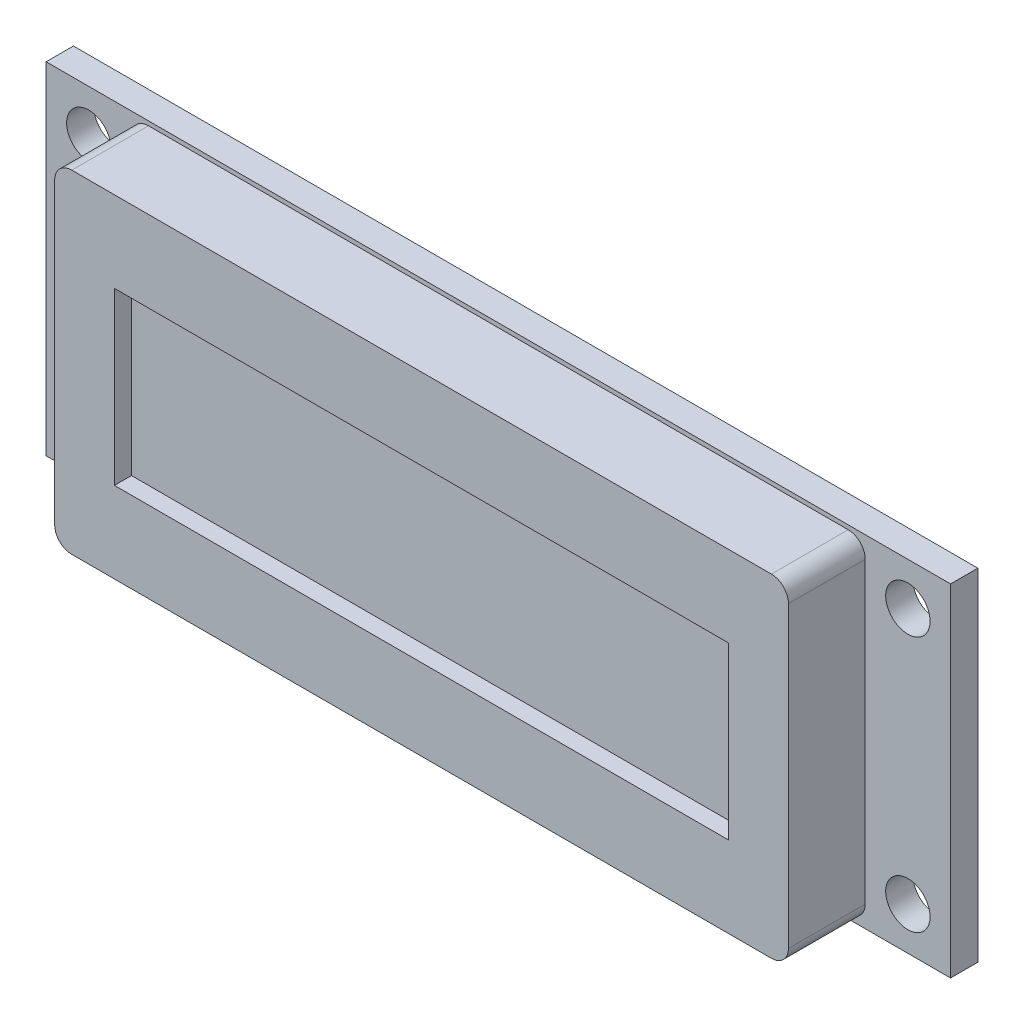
ISO-10303-21;
HEADER;
FILE_DESCRIPTION(('STEP AP214'),'2;1');
FILE_NAME('part.step','',(''),(''),'','','');
FILE_SCHEMA(('AUTOMOTIVE_DESIGN { 1 0 10303 214 1 1 1 1 }'));
ENDSEC;
DATA;
#1=APPLICATION_CONTEXT('core data for automotive mechanical design processes');
#2=APPLICATION_PROTOCOL_DEFINITION('international standard','automotive_design',2000,#1);
#3=PRODUCT_CONTEXT('',#1,'mechanical');
#4=PRODUCT('Part','Part','',(#3));
#5=PRODUCT_RELATED_PRODUCT_CATEGORY('part','',(#4));
#6=PRODUCT_DEFINITION_FORMATION('','',#4);
#7=PRODUCT_DEFINITION_CONTEXT('part definition',#1,'design');
#8=PRODUCT_DEFINITION('design','',#6,#7);
#9=PRODUCT_DEFINITION_SHAPE('','',#8);
#10=(LENGTH_UNIT() NAMED_UNIT(*) SI_UNIT(.MILLI.,.METRE.));
#11=(NAMED_UNIT(*) PLANE_ANGLE_UNIT() SI_UNIT($,.RADIAN.));
#12=(NAMED_UNIT(*) SI_UNIT($,.STERADIAN.) SOLID_ANGLE_UNIT());
#13=UNCERTAINTY_MEASURE_WITH_UNIT(LENGTH_MEASURE(1.E-05),#10,'distance_accuracy_value','');
#14=(GEOMETRIC_REPRESENTATION_CONTEXT(3) GLOBAL_UNCERTAINTY_ASSIGNED_CONTEXT((#13)) GLOBAL_UNIT_ASSIGNED_CONTEXT((#10,
#11,#12)) REPRESENTATION_CONTEXT('',''));
#15=CARTESIAN_POINT('',(0.,0.,0.));
#16=DIRECTION('',(0.,0.,1.));
#17=DIRECTION('',(1.,0.,0.));
#18=AXIS2_PLACEMENT_3D('',#15,#16,#17);
#19=CARTESIAN_POINT('',(0.,5.,4.5));
#20=DIRECTION('',(0.,1.,0.));
#21=DIRECTION('',(0.,0.,1.));
#22=AXIS2_PLACEMENT_3D('',#19,#20,#21);
#23=PLANE('',#22);
#24=DIRECTION('',(-1.,0.,0.));
#25=VECTOR('',#24,1.);
#26=CARTESIAN_POINT('',(18.,5.,3.5));
#27=LINE('',#26,#25);
#28=CARTESIAN_POINT('',(18.,5.,3.5));
#29=VERTEX_POINT('',#28);
#30=CARTESIAN_POINT('',(-18.,5.,3.5));
#31=VERTEX_POINT('',#30);
#32=EDGE_CURVE('E254',#29,#31,#27,.T.);
#33=ORIENTED_EDGE('',*,*,#32,.F.);
#34=DIRECTION('',(0.,0.,-1.));
#35=VECTOR('',#34,1.);
#36=CARTESIAN_POINT('',(18.,5.,4.5));
#37=LINE('',#36,#35);
#38=CARTESIAN_POINT('',(18.,5.,4.5));
#39=VERTEX_POINT('',#38);
#40=EDGE_CURVE('E329',#39,#29,#37,.T.);
#41=ORIENTED_EDGE('',*,*,#40,.F.);
#42=DIRECTION('',(1.,0.,0.));
#43=VECTOR('',#42,1.);
#44=CARTESIAN_POINT('',(0.,5.,4.5));
#45=LINE('',#44,#43);
#46=CARTESIAN_POINT('',(-18.,5.,4.5));
#47=VERTEX_POINT('',#46);
#48=EDGE_CURVE('E266',#47,#39,#45,.T.);
#49=ORIENTED_EDGE('',*,*,#48,.F.);
#50=DIRECTION('',(0.,0.,-1.));
#51=VECTOR('',#50,1.);
#52=CARTESIAN_POINT('',(-18.,5.,4.5));
#53=LINE('',#52,#51);
#54=EDGE_CURVE('E243',#47,#31,#53,.T.);
#55=ORIENTED_EDGE('',*,*,#54,.T.);
#56=EDGE_LOOP('',(#33,#41,#49,#55));
#57=FACE_BOUND('',#56,.T.);
#58=ADVANCED_FACE('F95',(#57),#23,.F.);
#59=CARTESIAN_POINT('',(18.,0.,4.5));
#60=DIRECTION('',(1.,0.,0.));
#61=DIRECTION('',(0.,0.,-1.));
#62=AXIS2_PLACEMENT_3D('',#59,#60,#61);
#63=PLANE('',#62);
#64=DIRECTION('',(0.,1.,0.));
#65=VECTOR('',#64,1.);
#66=CARTESIAN_POINT('',(18.,5.,3.5));
#67=LINE('',#66,#65);
#68=CARTESIAN_POINT('',(18.,-5.,3.5));
#69=VERTEX_POINT('',#68);
#70=EDGE_CURVE('E257',#69,#29,#67,.T.);
#71=ORIENTED_EDGE('',*,*,#70,.F.);
#72=DIRECTION('',(0.,0.,-1.));
#73=VECTOR('',#72,1.);
#74=CARTESIAN_POINT('',(18.,-5.,4.5));
#75=LINE('',#74,#73);
#76=CARTESIAN_POINT('',(18.,-5.,4.5));
#77=VERTEX_POINT('',#76);
#78=EDGE_CURVE('E357',#77,#69,#75,.T.);
#79=ORIENTED_EDGE('',*,*,#78,.F.);
#80=DIRECTION('',(0.,-1.,0.));
#81=VECTOR('',#80,1.);
#82=CARTESIAN_POINT('',(18.,0.,4.5));
#83=LINE('',#82,#81);
#84=EDGE_CURVE('E269',#39,#77,#83,.T.);
#85=ORIENTED_EDGE('',*,*,#84,.F.);
#86=ORIENTED_EDGE('',*,*,#40,.T.);
#87=EDGE_LOOP('',(#71,#79,#85,#86));
#88=FACE_BOUND('',#87,.T.);
#89=ADVANCED_FACE('F440',(#88),#63,.F.);
#90=CARTESIAN_POINT('',(0.,-5.,4.5));
#91=DIRECTION('',(0.,1.,0.));
#92=DIRECTION('',(0.,0.,1.));
#93=AXIS2_PLACEMENT_3D('',#90,#91,#92);
#94=PLANE('',#93);
#95=ORIENTED_EDGE('',*,*,#78,.T.);
#96=DIRECTION('',(1.,0.,0.));
#97=VECTOR('',#96,1.);
#98=CARTESIAN_POINT('',(18.,-5.,3.5));
#99=LINE('',#98,#97);
#100=CARTESIAN_POINT('',(-18.,-5.,3.5));
#101=VERTEX_POINT('',#100);
#102=EDGE_CURVE('E263',#101,#69,#99,.T.);
#103=ORIENTED_EDGE('',*,*,#102,.F.);
#104=DIRECTION('',(0.,0.,-1.));
#105=VECTOR('',#104,1.);
#106=CARTESIAN_POINT('',(-18.,-5.,4.5));
#107=LINE('',#106,#105);
#108=CARTESIAN_POINT('',(-18.,-5.,4.5));
#109=VERTEX_POINT('',#108);
#110=EDGE_CURVE('E353',#109,#101,#107,.T.);
#111=ORIENTED_EDGE('',*,*,#110,.F.);
#112=DIRECTION('',(1.,0.,0.));
#113=VECTOR('',#112,1.);
#114=CARTESIAN_POINT('',(0.,-5.,4.5));
#115=LINE('',#114,#113);
#116=EDGE_CURVE('E272',#109,#77,#115,.T.);
#117=ORIENTED_EDGE('',*,*,#116,.T.);
#118=EDGE_LOOP('',(#95,#103,#111,#117));
#119=FACE_BOUND('',#118,.T.);
#120=ADVANCED_FACE('F436',(#119),#94,.T.);
#121=CARTESIAN_POINT('',(-18.,0.,4.5));
#122=DIRECTION('',(1.,0.,0.));
#123=DIRECTION('',(0.,0.,-1.));
#124=AXIS2_PLACEMENT_3D('',#121,#122,#123);
#125=PLANE('',#124);
#126=ORIENTED_EDGE('',*,*,#110,.T.);
#127=DIRECTION('',(0.,-1.,0.));
#128=VECTOR('',#127,1.);
#129=CARTESIAN_POINT('',(-18.,5.,3.5));
#130=LINE('',#129,#128);
#131=EDGE_CURVE('E261',#31,#101,#130,.T.);
#132=ORIENTED_EDGE('',*,*,#131,.F.);
#133=ORIENTED_EDGE('',*,*,#54,.F.);
#134=DIRECTION('',(0.,-1.,0.));
#135=VECTOR('',#134,1.);
#136=CARTESIAN_POINT('',(-18.,0.,4.5));
#137=LINE('',#136,#135);
#138=EDGE_CURVE('E275',#47,#109,#137,.T.);
#139=ORIENTED_EDGE('',*,*,#138,.T.);
#140=EDGE_LOOP('',(#126,#132,#133,#139));
#141=FACE_BOUND('',#140,.T.);
#142=ADVANCED_FACE('F431',(#141),#125,.T.);
#143=CARTESIAN_POINT('',(26.5,10.,-1.6));
#144=DIRECTION('',(-1.,0.,0.));
#145=DIRECTION('',(0.,-1.,0.));
#146=AXIS2_PLACEMENT_3D('',#143,#144,#145);
#147=PLANE('',#146);
#148=DIRECTION('',(0.,-1.,0.));
#149=VECTOR('',#148,1.);
#150=CARTESIAN_POINT('',(26.5,10.,0.));
#151=LINE('',#150,#149);
#152=CARTESIAN_POINT('',(26.5,10.,0.));
#153=VERTEX_POINT('',#152);
#154=CARTESIAN_POINT('',(26.5,-9.99999999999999,0.));
#155=VERTEX_POINT('',#154);
#156=EDGE_CURVE('E383',#153,#155,#151,.T.);
#157=ORIENTED_EDGE('',*,*,#156,.T.);
#158=DIRECTION('',(0.,0.,1.));
#159=VECTOR('',#158,1.);
#160=CARTESIAN_POINT('',(26.5,-9.99999999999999,-1.6));
#161=LINE('',#160,#159);
#162=CARTESIAN_POINT('',(26.5,-9.99999999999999,-1.6));
#163=VERTEX_POINT('',#162);
#164=EDGE_CURVE('E12',#163,#155,#161,.T.);
#165=ORIENTED_EDGE('',*,*,#164,.F.);
#166=DIRECTION('',(0.,-1.,0.));
#167=VECTOR('',#166,1.);
#168=CARTESIAN_POINT('',(26.5,10.,-1.6));
#169=LINE('',#168,#167);
#170=CARTESIAN_POINT('',(26.5,10.,-1.6));
#171=VERTEX_POINT('',#170);
#172=EDGE_CURVE('E386',#171,#163,#169,.T.);
#173=ORIENTED_EDGE('',*,*,#172,.F.);
#174=DIRECTION('',(0.,0.,1.));
#175=VECTOR('',#174,1.);
#176=CARTESIAN_POINT('',(26.5,10.,-1.6));
#177=LINE('',#176,#175);
#178=EDGE_CURVE('E398',#171,#153,#177,.T.);
#179=ORIENTED_EDGE('',*,*,#178,.T.);
#180=EDGE_LOOP('',(#157,#165,#173,#179));
#181=FACE_BOUND('',#180,.T.);
#182=ADVANCED_FACE('F97',(#181),#147,.F.);
#183=CARTESIAN_POINT('',(26.5,-9.99999999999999,-1.6));
#184=DIRECTION('',(0.,1.,0.));
#185=DIRECTION('',(-1.,0.,0.));
#186=AXIS2_PLACEMENT_3D('',#183,#184,#185);
#187=PLANE('',#186);
#188=DIRECTION('',(-1.,0.,0.));
#189=VECTOR('',#188,1.);
#190=CARTESIAN_POINT('',(26.5,-9.99999999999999,0.));
#191=LINE('',#190,#189);
#192=CARTESIAN_POINT('',(-26.5,-10.,0.));
#193=VERTEX_POINT('',#192);
#194=EDGE_CURVE('E401',#155,#193,#191,.T.);
#195=ORIENTED_EDGE('',*,*,#194,.T.);
#196=DIRECTION('',(0.,0.,1.));
#197=VECTOR('',#196,1.);
#198=CARTESIAN_POINT('',(-26.5,-10.,-1.6));
#199=LINE('',#198,#197);
#200=CARTESIAN_POINT('',(-26.5,-10.,-1.6));
#201=VERTEX_POINT('',#200);
#202=EDGE_CURVE('E104',#201,#193,#199,.T.);
#203=ORIENTED_EDGE('',*,*,#202,.F.);
#204=DIRECTION('',(-1.,0.,0.));
#205=VECTOR('',#204,1.);
#206=CARTESIAN_POINT('',(26.5,-9.99999999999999,-1.6));
#207=LINE('',#206,#205);
#208=EDGE_CURVE('E389',#163,#201,#207,.T.);
#209=ORIENTED_EDGE('',*,*,#208,.F.);
#210=ORIENTED_EDGE('',*,*,#164,.T.);
#211=EDGE_LOOP('',(#195,#203,#209,#210));
#212=FACE_BOUND('',#211,.T.);
#213=ADVANCED_FACE('F417',(#212),#187,.F.);
#214=CARTESIAN_POINT('',(-26.5,10.,-1.6));
#215=DIRECTION('',(-1.,0.,0.));
#216=DIRECTION('',(0.,-1.,0.));
#217=AXIS2_PLACEMENT_3D('',#214,#215,#216);
#218=PLANE('',#217);
#219=DIRECTION('',(0.,-1.,0.));
#220=VECTOR('',#219,1.);
#221=CARTESIAN_POINT('',(-26.5,10.,0.));
#222=LINE('',#221,#220);
#223=CARTESIAN_POINT('',(-26.5,10.,0.));
#224=VERTEX_POINT('',#223);
#225=EDGE_CURVE('E404',#224,#193,#222,.T.);
#226=ORIENTED_EDGE('',*,*,#225,.F.);
#227=DIRECTION('',(0.,0.,1.));
#228=VECTOR('',#227,1.);
#229=CARTESIAN_POINT('',(-26.5,10.,-1.6));
#230=LINE('',#229,#228);
#231=CARTESIAN_POINT('',(-26.5,10.,-1.6));
#232=VERTEX_POINT('',#231);
#233=EDGE_CURVE('E410',#232,#224,#230,.T.);
#234=ORIENTED_EDGE('',*,*,#233,.F.);
#235=DIRECTION('',(0.,-1.,0.));
#236=VECTOR('',#235,1.);
#237=CARTESIAN_POINT('',(-26.5,10.,-1.6));
#238=LINE('',#237,#236);
#239=EDGE_CURVE('E392',#232,#201,#238,.T.);
#240=ORIENTED_EDGE('',*,*,#239,.T.);
#241=ORIENTED_EDGE('',*,*,#202,.T.);
#242=EDGE_LOOP('',(#226,#234,#240,#241));
#243=FACE_BOUND('',#242,.T.);
#244=ADVANCED_FACE('F414',(#243),#218,.T.);
#245=CARTESIAN_POINT('',(26.5,10.,-1.6));
#246=DIRECTION('',(0.,1.,0.));
#247=DIRECTION('',(-1.,0.,0.));
#248=AXIS2_PLACEMENT_3D('',#245,#246,#247);
#249=PLANE('',#248);
#250=DIRECTION('',(-1.,0.,0.));
#251=VECTOR('',#250,1.);
#252=CARTESIAN_POINT('',(26.5,10.,0.));
#253=LINE('',#252,#251);
#254=EDGE_CURVE('E390',#153,#224,#253,.T.);
#255=ORIENTED_EDGE('',*,*,#254,.F.);
#256=ORIENTED_EDGE('',*,*,#178,.F.);
#257=DIRECTION('',(-1.,0.,0.));
#258=VECTOR('',#257,1.);
#259=CARTESIAN_POINT('',(26.5,10.,-1.6));
#260=LINE('',#259,#258);
#261=EDGE_CURVE('E395',#171,#232,#260,.T.);
#262=ORIENTED_EDGE('',*,*,#261,.T.);
#263=ORIENTED_EDGE('',*,*,#233,.T.);
#264=EDGE_LOOP('',(#255,#256,#262,#263));
#265=FACE_BOUND('',#264,.T.);
#266=ADVANCED_FACE('F424',(#265),#249,.T.);
#267=CARTESIAN_POINT('',(0.,0.,-1.6));
#268=DIRECTION('',(0.,0.,-1.));
#269=DIRECTION('',(-1.,0.,0.));
#270=AXIS2_PLACEMENT_3D('',#267,#268,#269);
#271=PLANE('',#270);
#272=CARTESIAN_POINT('',(24.,-7.49999999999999,-1.6));
#273=DIRECTION('',(0.,0.,1.));
#274=DIRECTION('',(1.,0.,0.));
#275=AXIS2_PLACEMENT_3D('',#272,#273,#274);
#276=CIRCLE('',#275,1.3);
#277=CARTESIAN_POINT('',(25.3,-7.49999999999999,-1.6));
#278=VERTEX_POINT('',#277);
#279=EDGE_CURVE('E362',#278,#278,#276,.T.);
#280=ORIENTED_EDGE('',*,*,#279,.T.);
#281=EDGE_LOOP('',(#280));
#282=FACE_BOUND('',#281,.T.);
#283=CARTESIAN_POINT('',(-24.,-7.49999999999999,-1.6));
#284=DIRECTION('',(0.,0.,1.));
#285=DIRECTION('',(1.,0.,0.));
#286=AXIS2_PLACEMENT_3D('',#283,#284,#285);
#287=CIRCLE('',#286,1.3);
#288=CARTESIAN_POINT('',(-22.7,-7.49999999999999,-1.6));
#289=VERTEX_POINT('',#288);
#290=EDGE_CURVE('E368',#289,#289,#287,.T.);
#291=ORIENTED_EDGE('',*,*,#290,.T.);
#292=EDGE_LOOP('',(#291));
#293=FACE_BOUND('',#292,.T.);
#294=CARTESIAN_POINT('',(-24.,7.50000000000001,-1.6));
#295=DIRECTION('',(0.,0.,1.));
#296=DIRECTION('',(1.,0.,0.));
#297=AXIS2_PLACEMENT_3D('',#294,#295,#296);
#298=CIRCLE('',#297,1.3);
#299=CARTESIAN_POINT('',(-22.7,7.50000000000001,-1.6));
#300=VERTEX_POINT('',#299);
#301=EDGE_CURVE('E374',#300,#300,#298,.T.);
#302=ORIENTED_EDGE('',*,*,#301,.T.);
#303=EDGE_LOOP('',(#302));
#304=FACE_BOUND('',#303,.T.);
#305=CARTESIAN_POINT('',(24.,7.50000000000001,-1.6));
#306=DIRECTION('',(0.,0.,1.));
#307=DIRECTION('',(1.,0.,0.));
#308=AXIS2_PLACEMENT_3D('',#305,#306,#307);
#309=CIRCLE('',#308,1.3);
#310=CARTESIAN_POINT('',(25.3,7.50000000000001,-1.6));
#311=VERTEX_POINT('',#310);
#312=EDGE_CURVE('E380',#311,#311,#309,.T.);
#313=ORIENTED_EDGE('',*,*,#312,.T.);
#314=EDGE_LOOP('',(#313));
#315=FACE_BOUND('',#314,.T.);
#316=ORIENTED_EDGE('',*,*,#172,.T.);
#317=ORIENTED_EDGE('',*,*,#208,.T.);
#318=ORIENTED_EDGE('',*,*,#239,.F.);
#319=ORIENTED_EDGE('',*,*,#261,.F.);
#320=EDGE_LOOP('',(#316,#317,#318,#319));
#321=FACE_BOUND('',#320,.T.);
#322=ADVANCED_FACE('F428',(#282,#293,#304,#315,#321),#271,.T.);
#323=CARTESIAN_POINT('',(0.,0.,0.));
#324=DIRECTION('',(0.,0.,-1.));
#325=DIRECTION('',(-1.,0.,0.));
#326=AXIS2_PLACEMENT_3D('',#323,#324,#325);
#327=PLANE('',#326);
#328=DIRECTION('',(0.,-1.,0.));
#329=VECTOR('',#328,1.);
#330=CARTESIAN_POINT('',(-21.5,0.,0.));
#331=LINE('',#330,#329);
#332=CARTESIAN_POINT('',(-21.5,8.74999999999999,0.));
#333=VERTEX_POINT('',#332);
#334=CARTESIAN_POINT('',(-21.5,-8.75,0.));
#335=VERTEX_POINT('',#334);
#336=EDGE_CURVE('E305',#333,#335,#331,.T.);
#337=ORIENTED_EDGE('',*,*,#336,.F.);
#338=CARTESIAN_POINT('',(-20.5,8.74999999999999,0.));
#339=DIRECTION('',(0.,0.,1.));
#340=DIRECTION('',(1.,0.,0.));
#341=AXIS2_PLACEMENT_3D('',#338,#339,#340);
#342=CIRCLE('',#341,0.999999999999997);
#343=CARTESIAN_POINT('',(-20.5,9.74999999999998,0.));
#344=VERTEX_POINT('',#343);
#345=EDGE_CURVE('E270',#344,#333,#342,.T.);
#346=ORIENTED_EDGE('',*,*,#345,.F.);
#347=DIRECTION('',(1.,0.,0.));
#348=VECTOR('',#347,1.);
#349=CARTESIAN_POINT('',(0.,9.74999999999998,0.));
#350=LINE('',#349,#348);
#351=CARTESIAN_POINT('',(20.5,9.74999999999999,0.));
#352=VERTEX_POINT('',#351);
#353=EDGE_CURVE('E321',#344,#352,#350,.T.);
#354=ORIENTED_EDGE('',*,*,#353,.T.);
#355=CARTESIAN_POINT('',(20.5,8.74999999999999,0.));
#356=DIRECTION('',(0.,0.,1.));
#357=DIRECTION('',(1.,0.,0.));
#358=AXIS2_PLACEMENT_3D('',#355,#356,#357);
#359=CIRCLE('',#358,0.999999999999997);
#360=CARTESIAN_POINT('',(21.5,8.74999999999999,0.));
#361=VERTEX_POINT('',#360);
#362=EDGE_CURVE('E319',#352,#361,#359,.F.);
#363=ORIENTED_EDGE('',*,*,#362,.T.);
#364=DIRECTION('',(0.,-1.,0.));
#365=VECTOR('',#364,1.);
#366=CARTESIAN_POINT('',(21.5,0.,0.));
#367=LINE('',#366,#365);
#368=CARTESIAN_POINT('',(21.5,-8.74999999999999,0.));
#369=VERTEX_POINT('',#368);
#370=EDGE_CURVE('E317',#361,#369,#367,.T.);
#371=ORIENTED_EDGE('',*,*,#370,.T.);
#372=CARTESIAN_POINT('',(20.5,-8.75,0.));
#373=DIRECTION('',(0.,0.,1.));
#374=DIRECTION('',(1.,0.,0.));
#375=AXIS2_PLACEMENT_3D('',#372,#373,#374);
#376=CIRCLE('',#375,1.);
#377=CARTESIAN_POINT('',(20.5,-9.75,0.));
#378=VERTEX_POINT('',#377);
#379=EDGE_CURVE('E314',#378,#369,#376,.T.);
#380=ORIENTED_EDGE('',*,*,#379,.F.);
#381=DIRECTION('',(1.,0.,0.));
#382=VECTOR('',#381,1.);
#383=CARTESIAN_POINT('',(0.,-9.75,0.));
#384=LINE('',#383,#382);
#385=CARTESIAN_POINT('',(-20.5,-9.75,0.));
#386=VERTEX_POINT('',#385);
#387=EDGE_CURVE('E311',#386,#378,#384,.T.);
#388=ORIENTED_EDGE('',*,*,#387,.F.);
#389=CARTESIAN_POINT('',(-20.5,-8.75,0.));
#390=DIRECTION('',(0.,0.,1.));
#391=DIRECTION('',(1.,0.,0.));
#392=AXIS2_PLACEMENT_3D('',#389,#390,#391);
#393=CIRCLE('',#392,1.);
#394=EDGE_CURVE('E308',#335,#386,#393,.T.);
#395=ORIENTED_EDGE('',*,*,#394,.F.);
#396=EDGE_LOOP('',(#337,#346,#354,#363,#371,#380,#388,#395));
#397=FACE_BOUND('',#396,.T.);
#398=CARTESIAN_POINT('',(24.,-7.49999999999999,0.));
#399=DIRECTION('',(0.,0.,1.));
#400=DIRECTION('',(1.,0.,0.));
#401=AXIS2_PLACEMENT_3D('',#398,#399,#400);
#402=CIRCLE('',#401,1.3);
#403=CARTESIAN_POINT('',(25.3,-7.49999999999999,0.));
#404=VERTEX_POINT('',#403);
#405=EDGE_CURVE('E349',#404,#404,#402,.T.);
#406=ORIENTED_EDGE('',*,*,#405,.F.);
#407=EDGE_LOOP('',(#406));
#408=FACE_BOUND('',#407,.T.);
#409=CARTESIAN_POINT('',(-24.,-7.49999999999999,0.));
#410=DIRECTION('',(0.,0.,1.));
#411=DIRECTION('',(1.,0.,0.));
#412=AXIS2_PLACEMENT_3D('',#409,#410,#411);
#413=CIRCLE('',#412,1.3);
#414=CARTESIAN_POINT('',(-22.7,-7.49999999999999,0.));
#415=VERTEX_POINT('',#414);
#416=EDGE_CURVE('E365',#415,#415,#413,.T.);
#417=ORIENTED_EDGE('',*,*,#416,.F.);
#418=EDGE_LOOP('',(#417));
#419=FACE_BOUND('',#418,.T.);
#420=CARTESIAN_POINT('',(-24.,7.50000000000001,0.));
#421=DIRECTION('',(0.,0.,1.));
#422=DIRECTION('',(1.,0.,0.));
#423=AXIS2_PLACEMENT_3D('',#420,#421,#422);
#424=CIRCLE('',#423,1.3);
#425=CARTESIAN_POINT('',(-22.7,7.50000000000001,0.));
#426=VERTEX_POINT('',#425);
#427=EDGE_CURVE('E371',#426,#426,#424,.T.);
#428=ORIENTED_EDGE('',*,*,#427,.F.);
#429=EDGE_LOOP('',(#428));
#430=FACE_BOUND('',#429,.T.);
#431=CARTESIAN_POINT('',(24.,7.50000000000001,0.));
#432=DIRECTION('',(0.,0.,1.));
#433=DIRECTION('',(1.,0.,0.));
#434=AXIS2_PLACEMENT_3D('',#431,#432,#433);
#435=CIRCLE('',#434,1.3);
#436=CARTESIAN_POINT('',(25.3,7.50000000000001,0.));
#437=VERTEX_POINT('',#436);
#438=EDGE_CURVE('E377',#437,#437,#435,.T.);
#439=ORIENTED_EDGE('',*,*,#438,.F.);
#440=EDGE_LOOP('',(#439));
#441=FACE_BOUND('',#440,.T.);
#442=ORIENTED_EDGE('',*,*,#156,.F.);
#443=ORIENTED_EDGE('',*,*,#254,.T.);
#444=ORIENTED_EDGE('',*,*,#225,.T.);
#445=ORIENTED_EDGE('',*,*,#194,.F.);
#446=EDGE_LOOP('',(#442,#443,#444,#445));
#447=FACE_BOUND('',#446,.T.);
#448=ADVANCED_FACE('F421',(#397,#408,#419,#430,#441,#447),#327,.F.);
#449=CARTESIAN_POINT('',(24.,7.50000000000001,-1.6));
#450=DIRECTION('',(0.,0.,1.));
#451=DIRECTION('',(1.,0.,0.));
#452=AXIS2_PLACEMENT_3D('',#449,#450,#451);
#453=CYLINDRICAL_SURFACE('',#452,1.3);
#454=ORIENTED_EDGE('',*,*,#312,.F.);
#455=EDGE_LOOP('',(#454));
#456=FACE_BOUND('',#455,.T.);
#457=ORIENTED_EDGE('',*,*,#438,.T.);
#458=EDGE_LOOP('',(#457));
#459=FACE_BOUND('',#458,.T.);
#460=ADVANCED_FACE('F542',(#456,#459),#453,.F.);
#461=CARTESIAN_POINT('',(-24.,7.50000000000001,-1.6));
#462=DIRECTION('',(0.,0.,1.));
#463=DIRECTION('',(1.,0.,0.));
#464=AXIS2_PLACEMENT_3D('',#461,#462,#463);
#465=CYLINDRICAL_SURFACE('',#464,1.3);
#466=ORIENTED_EDGE('',*,*,#301,.F.);
#467=EDGE_LOOP('',(#466));
#468=FACE_BOUND('',#467,.T.);
#469=ORIENTED_EDGE('',*,*,#427,.T.);
#470=EDGE_LOOP('',(#469));
#471=FACE_BOUND('',#470,.T.);
#472=ADVANCED_FACE('F552',(#468,#471),#465,.F.);
#473=CARTESIAN_POINT('',(-24.,-7.49999999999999,-1.6));
#474=DIRECTION('',(0.,0.,1.));
#475=DIRECTION('',(1.,0.,0.));
#476=AXIS2_PLACEMENT_3D('',#473,#474,#475);
#477=CYLINDRICAL_SURFACE('',#476,1.3);
#478=ORIENTED_EDGE('',*,*,#290,.F.);
#479=EDGE_LOOP('',(#478));
#480=FACE_BOUND('',#479,.T.);
#481=ORIENTED_EDGE('',*,*,#416,.T.);
#482=EDGE_LOOP('',(#481));
#483=FACE_BOUND('',#482,.T.);
#484=ADVANCED_FACE('F558',(#480,#483),#477,.F.);
#485=CARTESIAN_POINT('',(24.,-7.49999999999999,-1.6));
#486=DIRECTION('',(0.,0.,1.));
#487=DIRECTION('',(1.,0.,0.));
#488=AXIS2_PLACEMENT_3D('',#485,#486,#487);
#489=CYLINDRICAL_SURFACE('',#488,1.3);
#490=ORIENTED_EDGE('',*,*,#279,.F.);
#491=EDGE_LOOP('',(#490));
#492=FACE_BOUND('',#491,.T.);
#493=ORIENTED_EDGE('',*,*,#405,.T.);
#494=EDGE_LOOP('',(#493));
#495=FACE_BOUND('',#494,.T.);
#496=ADVANCED_FACE('F504',(#492,#495),#489,.F.);
#497=CARTESIAN_POINT('',(-21.5,0.,4.5));
#498=DIRECTION('',(1.,0.,0.));
#499=DIRECTION('',(0.,1.,0.));
#500=AXIS2_PLACEMENT_3D('',#497,#498,#499);
#501=PLANE('',#500);
#502=ORIENTED_EDGE('',*,*,#336,.T.);
#503=DIRECTION('',(0.,0.,-1.));
#504=VECTOR('',#503,1.);
#505=CARTESIAN_POINT('',(-21.5,-8.74999999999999,4.5));
#506=LINE('',#505,#504);
#507=CARTESIAN_POINT('',(-21.5,-8.74999999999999,4.5));
#508=VERTEX_POINT('',#507);
#509=EDGE_CURVE('E347',#508,#335,#506,.T.);
#510=ORIENTED_EDGE('',*,*,#509,.F.);
#511=DIRECTION('',(0.,-1.,0.));
#512=VECTOR('',#511,1.);
#513=CARTESIAN_POINT('',(-21.5,0.,4.5));
#514=LINE('',#513,#512);
#515=CARTESIAN_POINT('',(-21.5,8.74999999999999,4.5));
#516=VERTEX_POINT('',#515);
#517=EDGE_CURVE('E278',#516,#508,#514,.T.);
#518=ORIENTED_EDGE('',*,*,#517,.F.);
#519=DIRECTION('',(0.,0.,-1.));
#520=VECTOR('',#519,1.);
#521=CARTESIAN_POINT('',(-21.5,8.74999999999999,4.5));
#522=LINE('',#521,#520);
#523=EDGE_CURVE('E325',#516,#333,#522,.T.);
#524=ORIENTED_EDGE('',*,*,#523,.T.);
#525=EDGE_LOOP('',(#502,#510,#518,#524));
#526=FACE_BOUND('',#525,.T.);
#527=ADVANCED_FACE('F501',(#526),#501,.F.);
#528=CARTESIAN_POINT('',(-20.5,-8.75,4.5));
#529=DIRECTION('',(0.,0.,-1.));
#530=DIRECTION('',(-1.,0.,0.));
#531=AXIS2_PLACEMENT_3D('',#528,#529,#530);
#532=CYLINDRICAL_SURFACE('',#531,1.);
#533=ORIENTED_EDGE('',*,*,#394,.T.);
#534=DIRECTION('',(0.,0.,-1.));
#535=VECTOR('',#534,1.);
#536=CARTESIAN_POINT('',(-20.5,-9.75,4.5));
#537=LINE('',#536,#535);
#538=CARTESIAN_POINT('',(-20.5,-9.75,4.5));
#539=VERTEX_POINT('',#538);
#540=EDGE_CURVE('E344',#539,#386,#537,.T.);
#541=ORIENTED_EDGE('',*,*,#540,.F.);
#542=CARTESIAN_POINT('',(-20.5,-8.75,4.5));
#543=DIRECTION('',(0.,0.,1.));
#544=DIRECTION('',(1.,0.,0.));
#545=AXIS2_PLACEMENT_3D('',#542,#543,#544);
#546=CIRCLE('',#545,1.);
#547=EDGE_CURVE('E281',#508,#539,#546,.T.);
#548=ORIENTED_EDGE('',*,*,#547,.F.);
#549=ORIENTED_EDGE('',*,*,#509,.T.);
#550=EDGE_LOOP('',(#533,#541,#548,#549));
#551=FACE_BOUND('',#550,.T.);
#552=ADVANCED_FACE('F497',(#551),#532,.T.);
#553=CARTESIAN_POINT('',(0.,-9.75,4.5));
#554=DIRECTION('',(0.,1.,0.));
#555=DIRECTION('',(0.,0.,1.));
#556=AXIS2_PLACEMENT_3D('',#553,#554,#555);
#557=PLANE('',#556);
#558=ORIENTED_EDGE('',*,*,#387,.T.);
#559=DIRECTION('',(0.,0.,-1.));
#560=VECTOR('',#559,1.);
#561=CARTESIAN_POINT('',(20.5,-9.75,4.5));
#562=LINE('',#561,#560);
#563=CARTESIAN_POINT('',(20.5,-9.75,4.5));
#564=VERTEX_POINT('',#563);
#565=EDGE_CURVE('E341',#564,#378,#562,.T.);
#566=ORIENTED_EDGE('',*,*,#565,.F.);
#567=DIRECTION('',(1.,0.,0.));
#568=VECTOR('',#567,1.);
#569=CARTESIAN_POINT('',(0.,-9.75,4.5));
#570=LINE('',#569,#568);
#571=EDGE_CURVE('E283',#539,#564,#570,.T.);
#572=ORIENTED_EDGE('',*,*,#571,.F.);
#573=ORIENTED_EDGE('',*,*,#540,.T.);
#574=EDGE_LOOP('',(#558,#566,#572,#573));
#575=FACE_BOUND('',#574,.T.);
#576=ADVANCED_FACE('F493',(#575),#557,.F.);
#577=CARTESIAN_POINT('',(20.5,-8.75,4.5));
#578=DIRECTION('',(0.,0.,-1.));
#579=DIRECTION('',(-1.,0.,0.));
#580=AXIS2_PLACEMENT_3D('',#577,#578,#579);
#581=CYLINDRICAL_SURFACE('',#580,1.);
#582=ORIENTED_EDGE('',*,*,#379,.T.);
#583=DIRECTION('',(0.,0.,-1.));
#584=VECTOR('',#583,1.);
#585=CARTESIAN_POINT('',(21.5,-8.74999999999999,4.5));
#586=LINE('',#585,#584);
#587=CARTESIAN_POINT('',(21.5,-8.74999999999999,4.5));
#588=VERTEX_POINT('',#587);
#589=EDGE_CURVE('E338',#588,#369,#586,.T.);
#590=ORIENTED_EDGE('',*,*,#589,.F.);
#591=CARTESIAN_POINT('',(20.5,-8.75,4.5));
#592=DIRECTION('',(0.,0.,1.));
#593=DIRECTION('',(1.,0.,0.));
#594=AXIS2_PLACEMENT_3D('',#591,#592,#593);
#595=CIRCLE('',#594,1.);
#596=EDGE_CURVE('E285',#564,#588,#595,.T.);
#597=ORIENTED_EDGE('',*,*,#596,.F.);
#598=ORIENTED_EDGE('',*,*,#565,.T.);
#599=EDGE_LOOP('',(#582,#590,#597,#598));
#600=FACE_BOUND('',#599,.T.);
#601=ADVANCED_FACE('F489',(#600),#581,.T.);
#602=CARTESIAN_POINT('',(21.5,0.,4.5));
#603=DIRECTION('',(1.,0.,0.));
#604=DIRECTION('',(0.,1.,0.));
#605=AXIS2_PLACEMENT_3D('',#602,#603,#604);
#606=PLANE('',#605);
#607=ORIENTED_EDGE('',*,*,#370,.F.);
#608=DIRECTION('',(0.,0.,-1.));
#609=VECTOR('',#608,1.);
#610=CARTESIAN_POINT('',(21.5,8.74999999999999,4.5));
#611=LINE('',#610,#609);
#612=CARTESIAN_POINT('',(21.5,8.74999999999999,4.5));
#613=VERTEX_POINT('',#612);
#614=EDGE_CURVE('E335',#613,#361,#611,.T.);
#615=ORIENTED_EDGE('',*,*,#614,.F.);
#616=DIRECTION('',(0.,-1.,0.));
#617=VECTOR('',#616,1.);
#618=CARTESIAN_POINT('',(21.5,0.,4.5));
#619=LINE('',#618,#617);
#620=EDGE_CURVE('E287',#613,#588,#619,.T.);
#621=ORIENTED_EDGE('',*,*,#620,.T.);
#622=ORIENTED_EDGE('',*,*,#589,.T.);
#623=EDGE_LOOP('',(#607,#615,#621,#622));
#624=FACE_BOUND('',#623,.T.);
#625=ADVANCED_FACE('F485',(#624),#606,.T.);
#626=CARTESIAN_POINT('',(20.5,8.74999999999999,4.5));
#627=DIRECTION('',(0.,0.,-1.));
#628=DIRECTION('',(-1.,0.,0.));
#629=AXIS2_PLACEMENT_3D('',#626,#627,#628);
#630=CYLINDRICAL_SURFACE('',#629,0.999999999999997);
#631=ORIENTED_EDGE('',*,*,#362,.F.);
#632=DIRECTION('',(0.,0.,-1.));
#633=VECTOR('',#632,1.);
#634=CARTESIAN_POINT('',(20.5,9.74999999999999,4.5));
#635=LINE('',#634,#633);
#636=CARTESIAN_POINT('',(20.5,9.74999999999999,4.5));
#637=VERTEX_POINT('',#636);
#638=EDGE_CURVE('E332',#637,#352,#635,.T.);
#639=ORIENTED_EDGE('',*,*,#638,.F.);
#640=CARTESIAN_POINT('',(20.5,8.74999999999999,4.5));
#641=DIRECTION('',(0.,0.,1.));
#642=DIRECTION('',(1.,0.,0.));
#643=AXIS2_PLACEMENT_3D('',#640,#641,#642);
#644=CIRCLE('',#643,0.999999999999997);
#645=EDGE_CURVE('E290',#637,#613,#644,.F.);
#646=ORIENTED_EDGE('',*,*,#645,.T.);
#647=ORIENTED_EDGE('',*,*,#614,.T.);
#648=EDGE_LOOP('',(#631,#639,#646,#647));
#649=FACE_BOUND('',#648,.T.);
#650=ADVANCED_FACE('F481',(#649),#630,.T.);
#651=CARTESIAN_POINT('',(0.,9.74999999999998,4.5));
#652=DIRECTION('',(0.,1.,0.));
#653=DIRECTION('',(-1.,0.,0.));
#654=AXIS2_PLACEMENT_3D('',#651,#652,#653);
#655=PLANE('',#654);
#656=ORIENTED_EDGE('',*,*,#353,.F.);
#657=DIRECTION('',(0.,0.,-1.));
#658=VECTOR('',#657,1.);
#659=CARTESIAN_POINT('',(-20.5,9.74999999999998,4.5));
#660=LINE('',#659,#658);
#661=CARTESIAN_POINT('',(-20.5,9.74999999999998,4.5));
#662=VERTEX_POINT('',#661);
#663=EDGE_CURVE('E328',#662,#344,#660,.T.);
#664=ORIENTED_EDGE('',*,*,#663,.F.);
#665=DIRECTION('',(1.,0.,0.));
#666=VECTOR('',#665,1.);
#667=CARTESIAN_POINT('',(0.,9.74999999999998,4.5));
#668=LINE('',#667,#666);
#669=EDGE_CURVE('E293',#662,#637,#668,.T.);
#670=ORIENTED_EDGE('',*,*,#669,.T.);
#671=ORIENTED_EDGE('',*,*,#638,.T.);
#672=EDGE_LOOP('',(#656,#664,#670,#671));
#673=FACE_BOUND('',#672,.T.);
#674=ADVANCED_FACE('F477',(#673),#655,.T.);
#675=CARTESIAN_POINT('',(-20.5,8.74999999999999,4.5));
#676=DIRECTION('',(0.,0.,-1.));
#677=DIRECTION('',(-1.,0.,0.));
#678=AXIS2_PLACEMENT_3D('',#675,#676,#677);
#679=CYLINDRICAL_SURFACE('',#678,0.999999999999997);
#680=ORIENTED_EDGE('',*,*,#345,.T.);
#681=ORIENTED_EDGE('',*,*,#523,.F.);
#682=CARTESIAN_POINT('',(-20.5,8.74999999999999,4.5));
#683=DIRECTION('',(0.,0.,1.));
#684=DIRECTION('',(1.,0.,0.));
#685=AXIS2_PLACEMENT_3D('',#682,#683,#684);
#686=CIRCLE('',#685,0.999999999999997);
#687=EDGE_CURVE('E244',#662,#516,#686,.T.);
#688=ORIENTED_EDGE('',*,*,#687,.F.);
#689=ORIENTED_EDGE('',*,*,#663,.T.);
#690=EDGE_LOOP('',(#680,#681,#688,#689));
#691=FACE_BOUND('',#690,.T.);
#692=ADVANCED_FACE('F473',(#691),#679,.T.);
#693=CARTESIAN_POINT('',(0.,0.,4.5));
#694=DIRECTION('',(0.,0.,1.));
#695=DIRECTION('',(1.,0.,0.));
#696=AXIS2_PLACEMENT_3D('',#693,#694,#695);
#697=PLANE('',#696);
#698=ORIENTED_EDGE('',*,*,#48,.T.);
#699=ORIENTED_EDGE('',*,*,#84,.T.);
#700=ORIENTED_EDGE('',*,*,#116,.F.);
#701=ORIENTED_EDGE('',*,*,#138,.F.);
#702=EDGE_LOOP('',(#698,#699,#700,#701));
#703=FACE_BOUND('',#702,.T.);
#704=ORIENTED_EDGE('',*,*,#517,.T.);
#705=ORIENTED_EDGE('',*,*,#547,.T.);
#706=ORIENTED_EDGE('',*,*,#571,.T.);
#707=ORIENTED_EDGE('',*,*,#596,.T.);
#708=ORIENTED_EDGE('',*,*,#620,.F.);
#709=ORIENTED_EDGE('',*,*,#645,.F.);
#710=ORIENTED_EDGE('',*,*,#669,.F.);
#711=ORIENTED_EDGE('',*,*,#687,.T.);
#712=EDGE_LOOP('',(#704,#705,#706,#707,#708,#709,#710,#711));
#713=FACE_BOUND('',#712,.T.);
#714=ADVANCED_FACE('F469',(#703,#713),#697,.T.);
#715=CARTESIAN_POINT('',(0.,0.,3.5));
#716=DIRECTION('',(0.,0.,-1.));
#717=DIRECTION('',(-1.,0.,0.));
#718=AXIS2_PLACEMENT_3D('',#715,#716,#717);
#719=PLANE('',#718);
#720=ORIENTED_EDGE('',*,*,#131,.T.);
#721=ORIENTED_EDGE('',*,*,#102,.T.);
#722=ORIENTED_EDGE('',*,*,#70,.T.);
#723=ORIENTED_EDGE('',*,*,#32,.T.);
#724=EDGE_LOOP('',(#720,#721,#722,#723));
#725=FACE_BOUND('',#724,.T.);
#726=ADVANCED_FACE('F467',(#725),#719,.F.);
#727=CLOSED_SHELL('',(#58,#89,#120,#142,#182,#213,#244,#266,#322,#448,#460,#472,#484,#496,#527,
#552,#576,#601,#625,#650,#674,#692,#714,#726));
#728=CARTESIAN_POINT('',(0.,0.,2.5));
#729=DIRECTION('',(0.,0.,-1.));
#730=DIRECTION('',(-1.,0.,0.));
#731=AXIS2_PLACEMENT_3D('',#728,#729,#730);
#732=PLANE('',#731);
#733=DIRECTION('',(0.,-1.,0.));
#734=VECTOR('',#733,1.);
#735=CARTESIAN_POINT('',(-18.,5.,2.5));
#736=LINE('',#735,#734);
#737=CARTESIAN_POINT('',(-18.,5.,2.5));
#738=VERTEX_POINT('',#737);
#739=CARTESIAN_POINT('',(-18.,-5.,2.5));
#740=VERTEX_POINT('',#739);
#741=EDGE_CURVE('E237',#738,#740,#736,.T.);
#742=ORIENTED_EDGE('',*,*,#741,.F.);
#743=DIRECTION('',(-1.,0.,0.));
#744=VECTOR('',#743,1.);
#745=CARTESIAN_POINT('',(18.,5.,2.5));
#746=LINE('',#745,#744);
#747=CARTESIAN_POINT('',(18.,5.,2.5));
#748=VERTEX_POINT('',#747);
#749=EDGE_CURVE('E247',#748,#738,#746,.T.);
#750=ORIENTED_EDGE('',*,*,#749,.F.);
#751=DIRECTION('',(0.,1.,0.));
#752=VECTOR('',#751,1.);
#753=CARTESIAN_POINT('',(18.,5.,2.5));
#754=LINE('',#753,#752);
#755=CARTESIAN_POINT('',(18.,-5.,2.5));
#756=VERTEX_POINT('',#755);
#757=EDGE_CURVE('E111',#756,#748,#754,.T.);
#758=ORIENTED_EDGE('',*,*,#757,.F.);
#759=DIRECTION('',(1.,0.,0.));
#760=VECTOR('',#759,1.);
#761=CARTESIAN_POINT('',(18.,-5.,2.5));
#762=LINE('',#761,#760);
#763=EDGE_CURVE('E119',#740,#756,#762,.T.);
#764=ORIENTED_EDGE('',*,*,#763,.F.);
#765=EDGE_LOOP('',(#742,#750,#758,#764));
#766=FACE_BOUND('',#765,.T.);
#767=ADVANCED_FACE('F253',(#766),#732,.T.);
#768=DIRECTION('',(1.,0.,0.));
#769=VECTOR('',#768,1.);
#770=CARTESIAN_POINT('',(0.,5.,0.));
#771=LINE('',#770,#769);
#772=CARTESIAN_POINT('',(-18.,5.,0.));
#773=VERTEX_POINT('',#772);
#774=CARTESIAN_POINT('',(18.,5.,0.));
#775=VERTEX_POINT('',#774);
#776=EDGE_CURVE('E251',#773,#775,#771,.T.);
#777=ORIENTED_EDGE('',*,*,#776,.F.);
#778=DIRECTION('',(0.,-1.,0.));
#779=VECTOR('',#778,1.);
#780=CARTESIAN_POINT('',(-18.,0.,0.));
#781=LINE('',#780,#779);
#782=CARTESIAN_POINT('',(-18.,-5.,0.));
#783=VERTEX_POINT('',#782);
#784=EDGE_CURVE('E239',#773,#783,#781,.T.);
#785=ORIENTED_EDGE('',*,*,#784,.T.);
#786=DIRECTION('',(1.,0.,0.));
#787=VECTOR('',#786,1.);
#788=CARTESIAN_POINT('',(0.,-5.,0.));
#789=LINE('',#788,#787);
#790=CARTESIAN_POINT('',(18.,-5.,0.));
#791=VERTEX_POINT('',#790);
#792=EDGE_CURVE('E301',#783,#791,#789,.T.);
#793=ORIENTED_EDGE('',*,*,#792,.T.);
#794=DIRECTION('',(0.,-1.,0.));
#795=VECTOR('',#794,1.);
#796=CARTESIAN_POINT('',(18.,0.,0.));
#797=LINE('',#796,#795);
#798=EDGE_CURVE('E298',#775,#791,#797,.T.);
#799=ORIENTED_EDGE('',*,*,#798,.F.);
#800=EDGE_LOOP('',(#777,#785,#793,#799));
#801=FACE_BOUND('',#800,.T.);
#802=ADVANCED_FACE('F458',(#801),#327,.F.);
#803=ORIENTED_EDGE('',*,*,#741,.T.);
#804=EDGE_CURVE('E352',#740,#783,#107,.T.);
#805=ORIENTED_EDGE('',*,*,#804,.T.);
#806=ORIENTED_EDGE('',*,*,#784,.F.);
#807=EDGE_CURVE('E233',#738,#773,#53,.T.);
#808=ORIENTED_EDGE('',*,*,#807,.F.);
#809=EDGE_LOOP('',(#803,#805,#806,#808));
#810=FACE_BOUND('',#809,.T.);
#811=ADVANCED_FACE('F235',(#810),#125,.T.);
#812=ORIENTED_EDGE('',*,*,#763,.T.);
#813=EDGE_CURVE('E356',#756,#791,#75,.T.);
#814=ORIENTED_EDGE('',*,*,#813,.T.);
#815=ORIENTED_EDGE('',*,*,#792,.F.);
#816=ORIENTED_EDGE('',*,*,#804,.F.);
#817=EDGE_LOOP('',(#812,#814,#815,#816));
#818=FACE_BOUND('',#817,.T.);
#819=ADVANCED_FACE('F456',(#818),#94,.T.);
#820=ORIENTED_EDGE('',*,*,#813,.F.);
#821=ORIENTED_EDGE('',*,*,#757,.T.);
#822=EDGE_CURVE('E249',#748,#775,#37,.T.);
#823=ORIENTED_EDGE('',*,*,#822,.T.);
#824=ORIENTED_EDGE('',*,*,#798,.T.);
#825=EDGE_LOOP('',(#820,#821,#823,#824));
#826=FACE_BOUND('',#825,.T.);
#827=ADVANCED_FACE('F448',(#826),#63,.F.);
#828=ORIENTED_EDGE('',*,*,#822,.F.);
#829=ORIENTED_EDGE('',*,*,#749,.T.);
#830=ORIENTED_EDGE('',*,*,#807,.T.);
#831=ORIENTED_EDGE('',*,*,#776,.T.);
#832=EDGE_LOOP('',(#828,#829,#830,#831));
#833=FACE_BOUND('',#832,.T.);
#834=ADVANCED_FACE('F248',(#833),#23,.F.);
#835=CLOSED_SHELL('',(#767,#802,#811,#819,#827,#834));
#836=ORIENTED_CLOSED_SHELL('',*,#835,.T.);
#837=BREP_WITH_VOIDS('B2',#727,(#836));
#838=ADVANCED_BREP_SHAPE_REPRESENTATION('',(#18,#837),#14);
#839=SHAPE_DEFINITION_REPRESENTATION(#9,#838);
ENDSEC;
END-ISO-10303-21;
